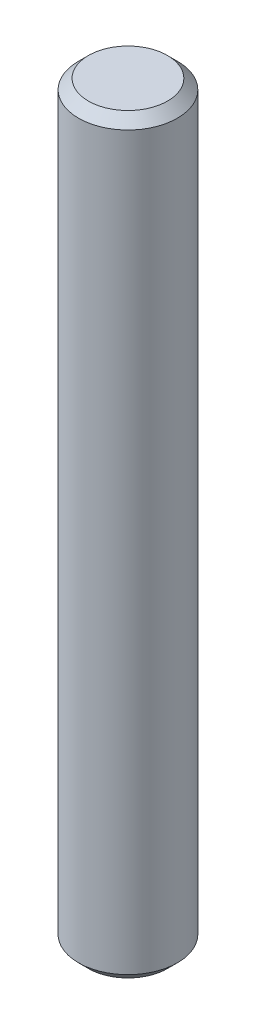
from build123d import *

# Parameters (mm, degrees)
SKETCH1_R      = 2.5
EXTRUDE1_DEPTH = 38
CHAMFER2_SIZE  = 0.5
CHAMFER3_SIZE  = 0.5


with BuildPart() as part:
    # Sketch1 → Extrude1 (new body)
    with BuildSketch(Plane(origin=(0, 0, 0), x_dir=(1, 0, 0), z_dir=(0, 1, 0))):
        with Locations(Location((0, 0, 0), (0, 0, 270))):
            Circle(SKETCH1_R)
    extrude(amount=EXTRUDE1_DEPTH)

    # Chamfer2
    chamfer2_edges = [part.edges().sort_by_distance(p)[0] for p in [
        (0, 38, -2.5),
    ]]
    chamfer(chamfer2_edges, length=CHAMFER2_SIZE)

    # Chamfer3
    chamfer3_edges = [part.edges().sort_by_distance(p)[0] for p in [
        (0, 0, -2.5),
    ]]
    chamfer(chamfer3_edges, length=CHAMFER3_SIZE)


solid = part.part
